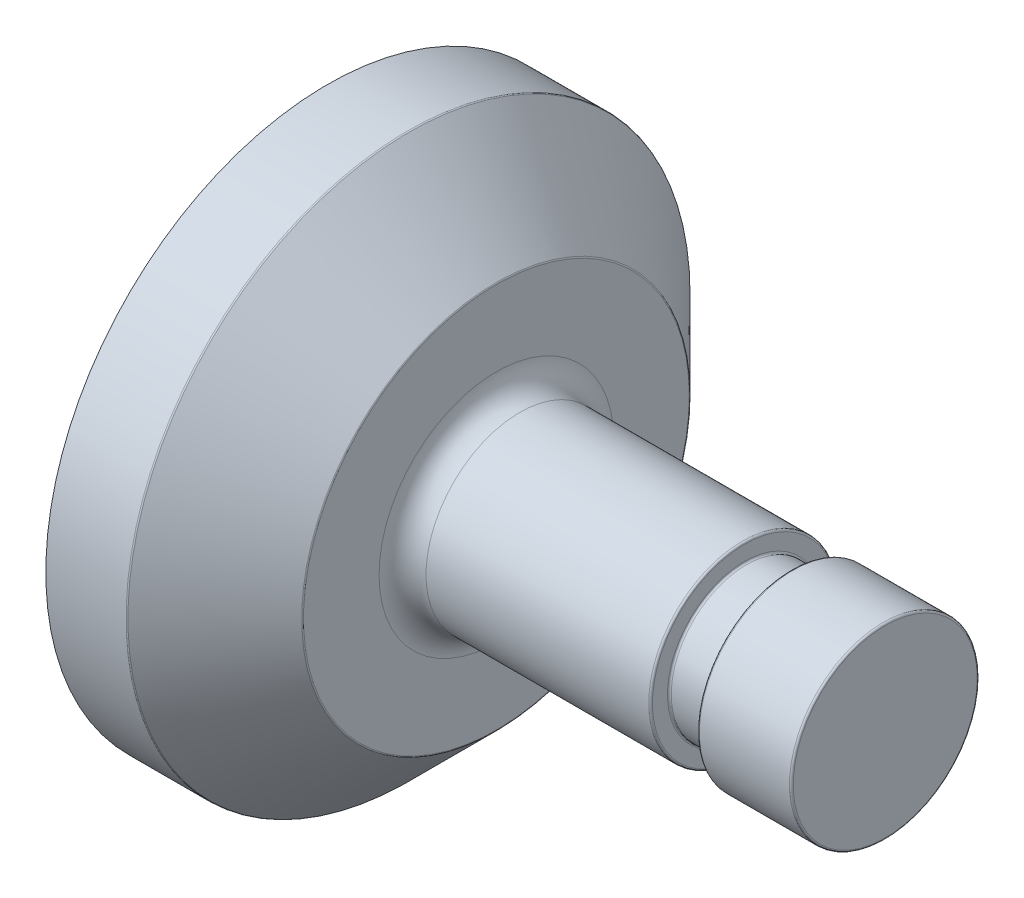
ISO-10303-21;
HEADER;
FILE_DESCRIPTION(('STEP AP214'),'2;1');
FILE_NAME('part.step','',(''),(''),'','','');
FILE_SCHEMA(('AUTOMOTIVE_DESIGN { 1 0 10303 214 1 1 1 1 }'));
ENDSEC;
DATA;
#1=APPLICATION_CONTEXT('core data for automotive mechanical design processes');
#2=APPLICATION_PROTOCOL_DEFINITION('international standard','automotive_design',2000,#1);
#3=PRODUCT_CONTEXT('',#1,'mechanical');
#4=PRODUCT('Part','Part','',(#3));
#5=PRODUCT_RELATED_PRODUCT_CATEGORY('part','',(#4));
#6=PRODUCT_DEFINITION_FORMATION('','',#4);
#7=PRODUCT_DEFINITION_CONTEXT('part definition',#1,'design');
#8=PRODUCT_DEFINITION('design','',#6,#7);
#9=PRODUCT_DEFINITION_SHAPE('','',#8);
#10=(LENGTH_UNIT() NAMED_UNIT(*) SI_UNIT(.MILLI.,.METRE.));
#11=(NAMED_UNIT(*) PLANE_ANGLE_UNIT() SI_UNIT($,.RADIAN.));
#12=(NAMED_UNIT(*) SI_UNIT($,.STERADIAN.) SOLID_ANGLE_UNIT());
#13=UNCERTAINTY_MEASURE_WITH_UNIT(LENGTH_MEASURE(1.E-05),#10,'distance_accuracy_value','');
#14=(GEOMETRIC_REPRESENTATION_CONTEXT(3) GLOBAL_UNCERTAINTY_ASSIGNED_CONTEXT((#13)) GLOBAL_UNIT_ASSIGNED_CONTEXT((#10,
#11,#12)) REPRESENTATION_CONTEXT('',''));
#15=CARTESIAN_POINT('',(0.,0.,0.));
#16=DIRECTION('',(0.,0.,1.));
#17=DIRECTION('',(1.,0.,0.));
#18=AXIS2_PLACEMENT_3D('',#15,#16,#17);
#19=CARTESIAN_POINT('',(0.,0.,0.));
#20=DIRECTION('',(1.,0.,0.));
#21=DIRECTION('',(0.,0.,-1.));
#22=AXIS2_PLACEMENT_3D('',#19,#20,#21);
#23=PLANE('',#22);
#24=CARTESIAN_POINT('',(0.,0.,0.));
#25=DIRECTION('',(1.,0.,0.));
#26=DIRECTION('',(0.,0.,-1.));
#27=AXIS2_PLACEMENT_3D('',#24,#25,#26);
#28=CIRCLE('',#27,12.446);
#29=CARTESIAN_POINT('',(0.,0.,-12.446));
#30=VERTEX_POINT('',#29);
#31=EDGE_CURVE('E10',#30,#30,#28,.T.);
#32=ORIENTED_EDGE('',*,*,#31,.T.);
#33=EDGE_LOOP('',(#32));
#34=FACE_BOUND('',#33,.T.);
#35=ADVANCED_FACE('F35',(#34),#23,.T.);
#36=CARTESIAN_POINT('',(-0.254,0.,0.));
#37=DIRECTION('',(1.,0.,0.));
#38=DIRECTION('',(0.,0.,-1.));
#39=AXIS2_PLACEMENT_3D('',#36,#37,#38);
#40=TOROIDAL_SURFACE('',#39,12.446,0.254);
#41=CARTESIAN_POINT('',(-0.254000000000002,0.,0.));
#42=DIRECTION('',(1.,0.,0.));
#43=DIRECTION('',(0.,0.,-1.));
#44=AXIS2_PLACEMENT_3D('',#41,#42,#43);
#45=CIRCLE('',#44,12.7);
#46=CARTESIAN_POINT('',(-0.254000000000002,0.,-12.7));
#47=VERTEX_POINT('',#46);
#48=EDGE_CURVE('E41',#47,#47,#45,.T.);
#49=ORIENTED_EDGE('',*,*,#48,.T.);
#50=EDGE_LOOP('',(#49));
#51=FACE_BOUND('',#50,.T.);
#52=ORIENTED_EDGE('',*,*,#31,.F.);
#53=EDGE_LOOP('',(#52));
#54=FACE_BOUND('',#53,.T.);
#55=ADVANCED_FACE('F106',(#51,#54),#40,.T.);
#56=CARTESIAN_POINT('',(4.58242544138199,0.,0.));
#57=DIRECTION('',(1.,0.,0.));
#58=DIRECTION('',(0.,0.,-1.));
#59=AXIS2_PLACEMENT_3D('',#56,#57,#58);
#60=CYLINDRICAL_SURFACE('',#59,12.7);
#61=CARTESIAN_POINT('',(-12.446,0.,0.));
#62=DIRECTION('',(1.,0.,0.));
#63=DIRECTION('',(0.,0.,-1.));
#64=AXIS2_PLACEMENT_3D('',#61,#62,#63);
#65=CIRCLE('',#64,12.7);
#66=CARTESIAN_POINT('',(-12.446,0.,-12.7));
#67=VERTEX_POINT('',#66);
#68=EDGE_CURVE('E45',#67,#67,#65,.T.);
#69=ORIENTED_EDGE('',*,*,#68,.T.);
#70=EDGE_LOOP('',(#69));
#71=FACE_BOUND('',#70,.T.);
#72=ORIENTED_EDGE('',*,*,#48,.F.);
#73=EDGE_LOOP('',(#72));
#74=FACE_BOUND('',#73,.T.);
#75=ADVANCED_FACE('F110',(#71,#74),#60,.T.);
#76=CARTESIAN_POINT('',(-12.446,0.,0.));
#77=DIRECTION('',(1.,0.,0.));
#78=DIRECTION('',(0.,0.,-1.));
#79=AXIS2_PLACEMENT_3D('',#76,#77,#78);
#80=TOROIDAL_SURFACE('',#79,12.446,0.254);
#81=CARTESIAN_POINT('',(-12.7,0.,0.));
#82=DIRECTION('',(1.,0.,0.));
#83=DIRECTION('',(0.,0.,-1.));
#84=AXIS2_PLACEMENT_3D('',#81,#82,#83);
#85=CIRCLE('',#84,12.446);
#86=CARTESIAN_POINT('',(-12.7,0.,-12.446));
#87=VERTEX_POINT('',#86);
#88=EDGE_CURVE('E49',#87,#87,#85,.T.);
#89=ORIENTED_EDGE('',*,*,#88,.T.);
#90=EDGE_LOOP('',(#89));
#91=FACE_BOUND('',#90,.T.);
#92=ORIENTED_EDGE('',*,*,#68,.F.);
#93=EDGE_LOOP('',(#92));
#94=FACE_BOUND('',#93,.T.);
#95=ADVANCED_FACE('F114',(#91,#94),#80,.T.);
#96=CARTESIAN_POINT('',(-12.7,12.446,0.));
#97=DIRECTION('',(-1.,0.,0.));
#98=DIRECTION('',(0.,0.,1.));
#99=AXIS2_PLACEMENT_3D('',#96,#97,#98);
#100=PLANE('',#99);
#101=CARTESIAN_POINT('',(-12.7,0.,0.));
#102=DIRECTION('',(1.,0.,0.));
#103=DIRECTION('',(0.,0.,-1.));
#104=AXIS2_PLACEMENT_3D('',#101,#102,#103);
#105=CIRCLE('',#104,10.414);
#106=CARTESIAN_POINT('',(-12.7,0.,-10.414));
#107=VERTEX_POINT('',#106);
#108=EDGE_CURVE('E54',#107,#107,#105,.T.);
#109=ORIENTED_EDGE('',*,*,#108,.T.);
#110=EDGE_LOOP('',(#109));
#111=FACE_BOUND('',#110,.T.);
#112=ORIENTED_EDGE('',*,*,#88,.F.);
#113=EDGE_LOOP('',(#112));
#114=FACE_BOUND('',#113,.T.);
#115=ADVANCED_FACE('F121',(#111,#114),#100,.T.);
#116=CARTESIAN_POINT('',(-12.954,0.,0.));
#117=DIRECTION('',(1.,0.,0.));
#118=DIRECTION('',(0.,0.,-1.));
#119=AXIS2_PLACEMENT_3D('',#116,#117,#118);
#120=TOROIDAL_SURFACE('',#119,10.414,0.254);
#121=CARTESIAN_POINT('',(-12.954,0.,0.));
#122=DIRECTION('',(1.,0.,0.));
#123=DIRECTION('',(0.,0.,-1.));
#124=AXIS2_PLACEMENT_3D('',#121,#122,#123);
#125=CIRCLE('',#124,10.16);
#126=CARTESIAN_POINT('',(-12.954,0.,-10.16));
#127=VERTEX_POINT('',#126);
#128=EDGE_CURVE('E57',#127,#127,#125,.T.);
#129=ORIENTED_EDGE('',*,*,#128,.T.);
#130=EDGE_LOOP('',(#129));
#131=FACE_BOUND('',#130,.T.);
#132=ORIENTED_EDGE('',*,*,#108,.F.);
#133=EDGE_LOOP('',(#132));
#134=FACE_BOUND('',#133,.T.);
#135=ADVANCED_FACE('F125',(#131,#134),#120,.F.);
#136=CARTESIAN_POINT('',(4.58242544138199,0.,0.));
#137=DIRECTION('',(1.,0.,0.));
#138=DIRECTION('',(0.,0.,-1.));
#139=AXIS2_PLACEMENT_3D('',#136,#137,#138);
#140=CYLINDRICAL_SURFACE('',#139,10.16);
#141=CARTESIAN_POINT('',(-18.796,0.,0.));
#142=DIRECTION('',(1.,0.,0.));
#143=DIRECTION('',(0.,0.,-1.));
#144=AXIS2_PLACEMENT_3D('',#141,#142,#143);
#145=CIRCLE('',#144,10.16);
#146=CARTESIAN_POINT('',(-18.796,0.,-10.16));
#147=VERTEX_POINT('',#146);
#148=EDGE_CURVE('E60',#147,#147,#145,.T.);
#149=ORIENTED_EDGE('',*,*,#148,.T.);
#150=EDGE_LOOP('',(#149));
#151=FACE_BOUND('',#150,.T.);
#152=ORIENTED_EDGE('',*,*,#128,.F.);
#153=EDGE_LOOP('',(#152));
#154=FACE_BOUND('',#153,.T.);
#155=ADVANCED_FACE('F129',(#151,#154),#140,.T.);
#156=CARTESIAN_POINT('',(-18.796,0.,0.));
#157=DIRECTION('',(1.,0.,0.));
#158=DIRECTION('',(0.,0.,-1.));
#159=AXIS2_PLACEMENT_3D('',#156,#157,#158);
#160=TOROIDAL_SURFACE('',#159,10.414,0.254000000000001);
#161=CARTESIAN_POINT('',(-19.05,0.,0.));
#162=DIRECTION('',(1.,0.,0.));
#163=DIRECTION('',(0.,0.,-1.));
#164=AXIS2_PLACEMENT_3D('',#161,#162,#163);
#165=CIRCLE('',#164,10.414);
#166=CARTESIAN_POINT('',(-19.05,0.,-10.414));
#167=VERTEX_POINT('',#166);
#168=EDGE_CURVE('E63',#167,#167,#165,.T.);
#169=ORIENTED_EDGE('',*,*,#168,.T.);
#170=EDGE_LOOP('',(#169));
#171=FACE_BOUND('',#170,.T.);
#172=ORIENTED_EDGE('',*,*,#148,.F.);
#173=EDGE_LOOP('',(#172));
#174=FACE_BOUND('',#173,.T.);
#175=ADVANCED_FACE('F133',(#171,#174),#160,.F.);
#176=CARTESIAN_POINT('',(-19.05,10.414,0.));
#177=DIRECTION('',(1.,0.,0.));
#178=DIRECTION('',(0.,0.,-1.));
#179=AXIS2_PLACEMENT_3D('',#176,#177,#178);
#180=PLANE('',#179);
#181=CARTESIAN_POINT('',(-19.05,0.,0.));
#182=DIRECTION('',(1.,0.,0.));
#183=DIRECTION('',(0.,0.,-1.));
#184=AXIS2_PLACEMENT_3D('',#181,#182,#183);
#185=CIRCLE('',#184,12.446);
#186=CARTESIAN_POINT('',(-19.05,0.,-12.446));
#187=VERTEX_POINT('',#186);
#188=EDGE_CURVE('E66',#187,#187,#185,.T.);
#189=ORIENTED_EDGE('',*,*,#188,.T.);
#190=EDGE_LOOP('',(#189));
#191=FACE_BOUND('',#190,.T.);
#192=ORIENTED_EDGE('',*,*,#168,.F.);
#193=EDGE_LOOP('',(#192));
#194=FACE_BOUND('',#193,.T.);
#195=ADVANCED_FACE('F137',(#191,#194),#180,.T.);
#196=CARTESIAN_POINT('',(-19.304,0.,0.));
#197=DIRECTION('',(1.,0.,0.));
#198=DIRECTION('',(0.,0.,-1.));
#199=AXIS2_PLACEMENT_3D('',#196,#197,#198);
#200=TOROIDAL_SURFACE('',#199,12.446,0.254000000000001);
#201=CARTESIAN_POINT('',(-19.304,0.,0.));
#202=DIRECTION('',(1.,0.,0.));
#203=DIRECTION('',(0.,0.,-1.));
#204=AXIS2_PLACEMENT_3D('',#201,#202,#203);
#205=CIRCLE('',#204,12.7);
#206=CARTESIAN_POINT('',(-19.304,0.,-12.7));
#207=VERTEX_POINT('',#206);
#208=EDGE_CURVE('E69',#207,#207,#205,.T.);
#209=ORIENTED_EDGE('',*,*,#208,.T.);
#210=EDGE_LOOP('',(#209));
#211=FACE_BOUND('',#210,.T.);
#212=ORIENTED_EDGE('',*,*,#188,.F.);
#213=EDGE_LOOP('',(#212));
#214=FACE_BOUND('',#213,.T.);
#215=ADVANCED_FACE('F141',(#211,#214),#200,.T.);
#216=CARTESIAN_POINT('',(4.58242544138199,0.,0.));
#217=DIRECTION('',(1.,0.,0.));
#218=DIRECTION('',(0.,0.,-1.));
#219=AXIS2_PLACEMENT_3D('',#216,#217,#218);
#220=CYLINDRICAL_SURFACE('',#219,12.7);
#221=CARTESIAN_POINT('',(-49.4327868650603,0.,0.));
#222=DIRECTION('',(1.,0.,0.));
#223=DIRECTION('',(0.,0.,-1.));
#224=AXIS2_PLACEMENT_3D('',#221,#222,#223);
#225=CIRCLE('',#224,12.7);
#226=CARTESIAN_POINT('',(-49.4327868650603,0.,-12.7));
#227=VERTEX_POINT('',#226);
#228=EDGE_CURVE('E72',#227,#227,#225,.T.);
#229=ORIENTED_EDGE('',*,*,#228,.T.);
#230=EDGE_LOOP('',(#229));
#231=FACE_BOUND('',#230,.T.);
#232=ORIENTED_EDGE('',*,*,#208,.F.);
#233=EDGE_LOOP('',(#232));
#234=FACE_BOUND('',#233,.T.);
#235=ADVANCED_FACE('F145',(#231,#234),#220,.T.);
#236=CARTESIAN_POINT('',(-49.4327868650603,0.,0.));
#237=DIRECTION('',(1.,0.,0.));
#238=DIRECTION('',(0.,0.,-1.));
#239=AXIS2_PLACEMENT_3D('',#236,#237,#238);
#240=TOROIDAL_SURFACE('',#239,15.875,3.175);
#241=CARTESIAN_POINT('',(-52.6077868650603,0.,0.));
#242=DIRECTION('',(1.,0.,0.));
#243=DIRECTION('',(0.,0.,-1.));
#244=AXIS2_PLACEMENT_3D('',#241,#242,#243);
#245=CIRCLE('',#244,15.875);
#246=CARTESIAN_POINT('',(-52.6077868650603,0.,-15.875));
#247=VERTEX_POINT('',#246);
#248=EDGE_CURVE('E75',#247,#247,#245,.T.);
#249=ORIENTED_EDGE('',*,*,#248,.T.);
#250=EDGE_LOOP('',(#249));
#251=FACE_BOUND('',#250,.T.);
#252=ORIENTED_EDGE('',*,*,#228,.F.);
#253=EDGE_LOOP('',(#252));
#254=FACE_BOUND('',#253,.T.);
#255=ADVANCED_FACE('F149',(#251,#254),#240,.F.);
#256=CARTESIAN_POINT('',(-52.6077868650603,15.875,0.));
#257=DIRECTION('',(1.,0.,0.));
#258=DIRECTION('',(0.,0.,-1.));
#259=AXIS2_PLACEMENT_3D('',#256,#257,#258);
#260=PLANE('',#259);
#261=CARTESIAN_POINT('',(-52.6077868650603,0.,0.));
#262=DIRECTION('',(1.,0.,0.));
#263=DIRECTION('',(0.,0.,-1.));
#264=AXIS2_PLACEMENT_3D('',#261,#262,#263);
#265=CIRCLE('',#264,26.0957996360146);
#266=CARTESIAN_POINT('',(-52.6077868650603,0.,-26.0957996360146));
#267=VERTEX_POINT('',#266);
#268=EDGE_CURVE('E78',#267,#267,#265,.T.);
#269=ORIENTED_EDGE('',*,*,#268,.T.);
#270=EDGE_LOOP('',(#269));
#271=FACE_BOUND('',#270,.T.);
#272=ORIENTED_EDGE('',*,*,#248,.F.);
#273=EDGE_LOOP('',(#272));
#274=FACE_BOUND('',#273,.T.);
#275=ADVANCED_FACE('F153',(#271,#274),#260,.T.);
#276=CARTESIAN_POINT('',(-52.8617868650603,0.,0.));
#277=DIRECTION('',(1.,0.,0.));
#278=DIRECTION('',(0.,0.,-1.));
#279=AXIS2_PLACEMENT_3D('',#276,#277,#278);
#280=TOROIDAL_SURFACE('',#279,26.0957996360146,0.254000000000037);
#281=CARTESIAN_POINT('',(-52.6821817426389,0.,0.));
#282=DIRECTION('',(1.,0.,0.));
#283=DIRECTION('',(0.,0.,-1.));
#284=AXIS2_PLACEMENT_3D('',#281,#282,#283);
#285=CIRCLE('',#284,26.275404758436);
#286=CARTESIAN_POINT('',(-52.6821817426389,0.,-26.275404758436));
#287=VERTEX_POINT('',#286);
#288=EDGE_CURVE('E81',#287,#287,#285,.T.);
#289=ORIENTED_EDGE('',*,*,#288,.T.);
#290=EDGE_LOOP('',(#289));
#291=FACE_BOUND('',#290,.T.);
#292=ORIENTED_EDGE('',*,*,#268,.F.);
#293=EDGE_LOOP('',(#292));
#294=FACE_BOUND('',#293,.T.);
#295=ADVANCED_FACE('F157',(#291,#294),#280,.T.);
#296=CARTESIAN_POINT('',(-52.6821817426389,0.,0.));
#297=DIRECTION('',(-1.,0.,0.));
#298=DIRECTION('',(0.,0.,1.));
#299=AXIS2_PLACEMENT_3D('',#296,#297,#298);
#300=CONICAL_SURFACE('',#299,26.275404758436,0.785398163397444);
#301=CARTESIAN_POINT('',(-64.4323821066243,0.,0.));
#302=DIRECTION('',(1.,0.,0.));
#303=DIRECTION('',(0.,0.,-1.));
#304=AXIS2_PLACEMENT_3D('',#301,#302,#303);
#305=CIRCLE('',#304,38.0256051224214);
#306=CARTESIAN_POINT('',(-64.4323821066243,0.,-38.0256051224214));
#307=VERTEX_POINT('',#306);
#308=EDGE_CURVE('E84',#307,#307,#305,.T.);
#309=ORIENTED_EDGE('',*,*,#308,.T.);
#310=EDGE_LOOP('',(#309));
#311=FACE_BOUND('',#310,.T.);
#312=ORIENTED_EDGE('',*,*,#288,.F.);
#313=EDGE_LOOP('',(#312));
#314=FACE_BOUND('',#313,.T.);
#315=ADVANCED_FACE('F161',(#311,#314),#300,.T.);
#316=CARTESIAN_POINT('',(-64.6119872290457,0.,0.));
#317=DIRECTION('',(1.,0.,0.));
#318=DIRECTION('',(0.,0.,-1.));
#319=AXIS2_PLACEMENT_3D('',#316,#317,#318);
#320=TOROIDAL_SURFACE('',#319,37.846,0.253999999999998);
#321=CARTESIAN_POINT('',(-64.6119872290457,0.,0.));
#322=DIRECTION('',(1.,0.,0.));
#323=DIRECTION('',(0.,0.,-1.));
#324=AXIS2_PLACEMENT_3D('',#321,#322,#323);
#325=CIRCLE('',#324,38.1);
#326=CARTESIAN_POINT('',(-64.6119872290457,0.,-38.1));
#327=VERTEX_POINT('',#326);
#328=EDGE_CURVE('E87',#327,#327,#325,.T.);
#329=ORIENTED_EDGE('',*,*,#328,.T.);
#330=EDGE_LOOP('',(#329));
#331=FACE_BOUND('',#330,.T.);
#332=ORIENTED_EDGE('',*,*,#308,.F.);
#333=EDGE_LOOP('',(#332));
#334=FACE_BOUND('',#333,.T.);
#335=ADVANCED_FACE('F103',(#331,#334),#320,.T.);
#336=CARTESIAN_POINT('',(4.58242544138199,0.,0.));
#337=DIRECTION('',(1.,0.,0.));
#338=DIRECTION('',(0.,0.,-1.));
#339=AXIS2_PLACEMENT_3D('',#336,#337,#338);
#340=CYLINDRICAL_SURFACE('',#339,38.1);
#341=CARTESIAN_POINT('',(-75.4707142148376,0.,0.));
#342=DIRECTION('',(1.,0.,0.));
#343=DIRECTION('',(0.,0.,-1.));
#344=AXIS2_PLACEMENT_3D('',#341,#342,#343);
#345=CIRCLE('',#344,38.1);
#346=CARTESIAN_POINT('',(-75.4707142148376,0.,-38.1));
#347=VERTEX_POINT('',#346);
#348=EDGE_CURVE('E90',#347,#347,#345,.T.);
#349=ORIENTED_EDGE('',*,*,#348,.T.);
#350=EDGE_LOOP('',(#349));
#351=FACE_BOUND('',#350,.T.);
#352=ORIENTED_EDGE('',*,*,#328,.F.);
#353=EDGE_LOOP('',(#352));
#354=FACE_BOUND('',#353,.T.);
#355=ADVANCED_FACE('F94',(#351,#354),#340,.T.);
#356=CARTESIAN_POINT('',(-75.4707142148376,38.1,0.));
#357=DIRECTION('',(-1.,0.,0.));
#358=DIRECTION('',(0.,0.,1.));
#359=AXIS2_PLACEMENT_3D('',#356,#357,#358);
#360=PLANE('',#359);
#361=ORIENTED_EDGE('',*,*,#348,.F.);
#362=EDGE_LOOP('',(#361));
#363=FACE_BOUND('',#362,.T.);
#364=ADVANCED_FACE('F97',(#363),#360,.T.);
#365=CLOSED_SHELL('',(#35,#55,#75,#95,#115,#135,#155,#175,#195,#215,#235,#255,#275,#295,#315,
#335,#355,#364));
#366=MANIFOLD_SOLID_BREP('B2',#365);
#367=ADVANCED_BREP_SHAPE_REPRESENTATION('',(#18,#366),#14);
#368=SHAPE_DEFINITION_REPRESENTATION(#9,#367);
ENDSEC;
END-ISO-10303-21;
